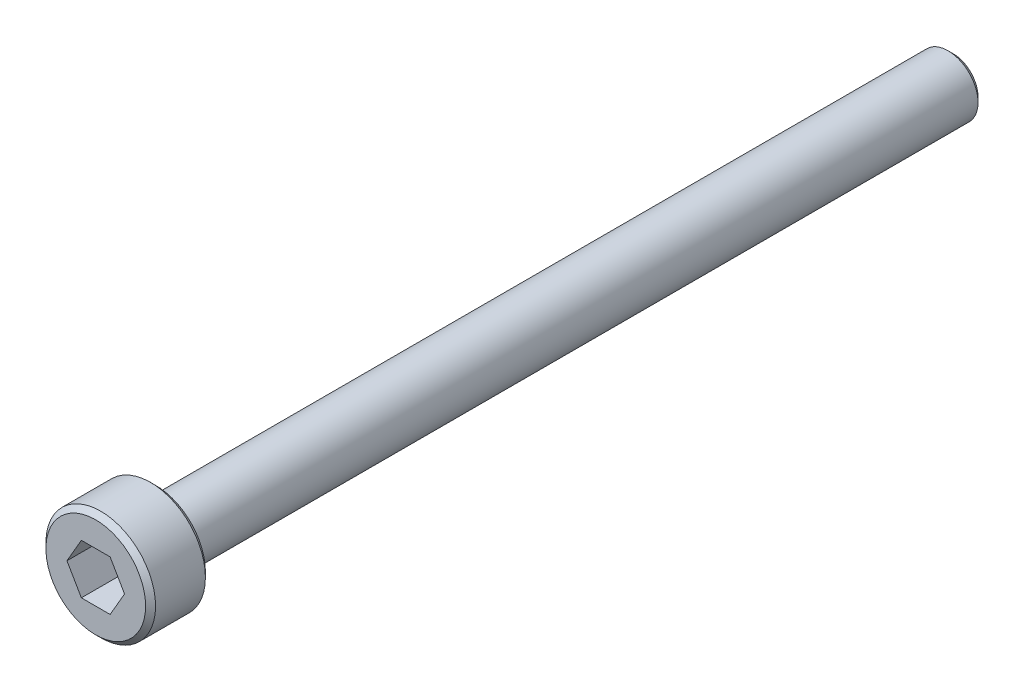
from build123d import *

# Parameters (mm, degrees)
SKETCH1_R           = 1.5
BOSS_EXTRUDE1_DEPTH = 40
SKETCH2_R           = 2.75
BOSS_EXTRUDE2_DEPTH = 3
CHAMFER1_SIZE       = 0.25
CUT_EXTRUDE1_DEPTH  = 2


with BuildPart() as part:
    # Sketch1 → Boss-Extrude1 (new body)
    with BuildSketch(Plane(origin=(0, 0, 0), x_dir=(0, 1, 0), z_dir=(0, 0, 1))):
        with Locations(Location((0, 0, 0), (0, 0, 270))):
            Circle(SKETCH1_R)
    extrude(amount=BOSS_EXTRUDE1_DEPTH)

    # Sketch2 → Boss-Extrude2 (add)
    with BuildSketch(Plane.XY.offset(40)):
        Circle(SKETCH2_R)
    extrude(amount=BOSS_EXTRUDE2_DEPTH)

    # Chamfer1
    chamfer1_edges = [part.edges().sort_by_distance(p)[0] for p in [
        (-1.5, 0, 0),
        (-2.75, 0, 40),
        (-2.75, 0, 43),
    ]]
    chamfer(chamfer1_edges, length=CHAMFER1_SIZE)

    # Sketch3 → Cut-Extrude1 (cut)
    with BuildSketch(Plane.XY.offset(43)):
        Polygon((1.443375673, 0), (0.721687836, 1.25), (-0.721687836, 1.25), (-1.443375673, 0), (-0.721687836, -1.25), (0.721687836, -1.25), align=None)
    extrude(amount=-CUT_EXTRUDE1_DEPTH, mode=Mode.SUBTRACT)


solid = part.part
